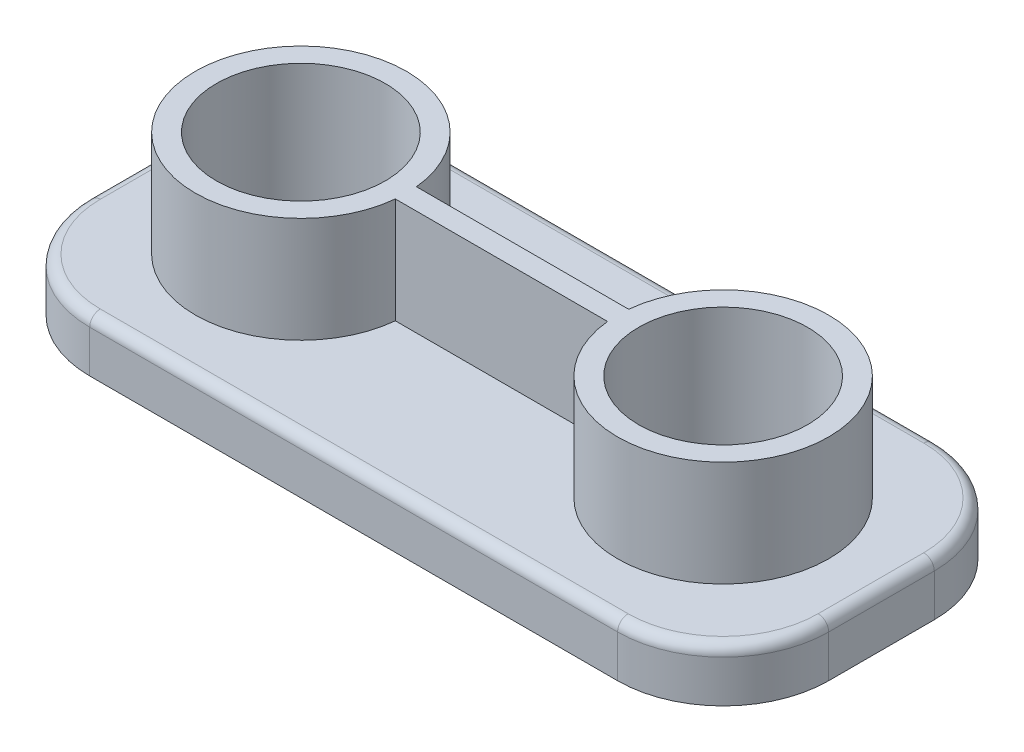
ISO-10303-21;
HEADER;
FILE_DESCRIPTION(('STEP AP214'),'2;1');
FILE_NAME('part.step','',(''),(''),'','','');
FILE_SCHEMA(('AUTOMOTIVE_DESIGN { 1 0 10303 214 1 1 1 1 }'));
ENDSEC;
DATA;
#1=APPLICATION_CONTEXT('core data for automotive mechanical design processes');
#2=APPLICATION_PROTOCOL_DEFINITION('international standard','automotive_design',2000,#1);
#3=PRODUCT_CONTEXT('',#1,'mechanical');
#4=PRODUCT('Part','Part','',(#3));
#5=PRODUCT_RELATED_PRODUCT_CATEGORY('part','',(#4));
#6=PRODUCT_DEFINITION_FORMATION('','',#4);
#7=PRODUCT_DEFINITION_CONTEXT('part definition',#1,'design');
#8=PRODUCT_DEFINITION('design','',#6,#7);
#9=PRODUCT_DEFINITION_SHAPE('','',#8);
#10=(LENGTH_UNIT() NAMED_UNIT(*) SI_UNIT(.MILLI.,.METRE.));
#11=(NAMED_UNIT(*) PLANE_ANGLE_UNIT() SI_UNIT($,.RADIAN.));
#12=(NAMED_UNIT(*) SI_UNIT($,.STERADIAN.) SOLID_ANGLE_UNIT());
#13=UNCERTAINTY_MEASURE_WITH_UNIT(LENGTH_MEASURE(1.E-05),#10,'distance_accuracy_value','');
#14=(GEOMETRIC_REPRESENTATION_CONTEXT(3) GLOBAL_UNCERTAINTY_ASSIGNED_CONTEXT((#13)) GLOBAL_UNIT_ASSIGNED_CONTEXT((#10,
#11,#12)) REPRESENTATION_CONTEXT('',''));
#15=CARTESIAN_POINT('',(0.,0.,0.));
#16=DIRECTION('',(0.,0.,1.));
#17=DIRECTION('',(1.,0.,0.));
#18=AXIS2_PLACEMENT_3D('',#15,#16,#17);
#19=CARTESIAN_POINT('',(-63.5,0.,-12.7));
#20=DIRECTION('',(0.,-1.,0.));
#21=DIRECTION('',(0.,0.,-1.));
#22=AXIS2_PLACEMENT_3D('',#19,#20,#21);
#23=PLANE('',#22);
#24=DIRECTION('',(0.,0.,-1.));
#25=VECTOR('',#24,1.);
#26=CARTESIAN_POINT('',(86.36,0.,-12.7));
#27=LINE('',#26,#25);
#28=CARTESIAN_POINT('',(86.36,0.,12.7));
#29=VERTEX_POINT('',#28);
#30=CARTESIAN_POINT('',(86.36,0.,-12.7));
#31=VERTEX_POINT('',#30);
#32=EDGE_CURVE('E220',#29,#31,#27,.T.);
#33=ORIENTED_EDGE('',*,*,#32,.T.);
#34=CARTESIAN_POINT('',(63.5,0.,-12.7));
#35=DIRECTION('',(0.,-1.,0.));
#36=DIRECTION('',(0.,0.,-1.));
#37=AXIS2_PLACEMENT_3D('',#34,#35,#36);
#38=CIRCLE('',#37,22.86);
#39=CARTESIAN_POINT('',(63.5,0.,-35.56));
#40=VERTEX_POINT('',#39);
#41=EDGE_CURVE('E222',#31,#40,#38,.F.);
#42=ORIENTED_EDGE('',*,*,#41,.T.);
#43=DIRECTION('',(-1.,0.,0.));
#44=VECTOR('',#43,1.);
#45=CARTESIAN_POINT('',(-63.5,0.,-35.56));
#46=LINE('',#45,#44);
#47=CARTESIAN_POINT('',(-63.5,0.,-35.56));
#48=VERTEX_POINT('',#47);
#49=EDGE_CURVE('E224',#40,#48,#46,.T.);
#50=ORIENTED_EDGE('',*,*,#49,.T.);
#51=CARTESIAN_POINT('',(-63.5,0.,-12.7));
#52=DIRECTION('',(0.,-1.,0.));
#53=DIRECTION('',(0.,0.,-1.));
#54=AXIS2_PLACEMENT_3D('',#51,#52,#53);
#55=CIRCLE('',#54,22.86);
#56=CARTESIAN_POINT('',(-86.36,0.,-12.7));
#57=VERTEX_POINT('',#56);
#58=EDGE_CURVE('E226',#48,#57,#55,.F.);
#59=ORIENTED_EDGE('',*,*,#58,.T.);
#60=DIRECTION('',(0.,0.,1.));
#61=VECTOR('',#60,1.);
#62=CARTESIAN_POINT('',(-86.36,0.,12.7));
#63=LINE('',#62,#61);
#64=CARTESIAN_POINT('',(-86.36,0.,12.7));
#65=VERTEX_POINT('',#64);
#66=EDGE_CURVE('E228',#57,#65,#63,.T.);
#67=ORIENTED_EDGE('',*,*,#66,.T.);
#68=CARTESIAN_POINT('',(-63.5,0.,12.7));
#69=DIRECTION('',(0.,-1.,0.));
#70=DIRECTION('',(0.,0.,-1.));
#71=AXIS2_PLACEMENT_3D('',#68,#69,#70);
#72=CIRCLE('',#71,22.86);
#73=CARTESIAN_POINT('',(-63.5,0.,35.56));
#74=VERTEX_POINT('',#73);
#75=EDGE_CURVE('E230',#65,#74,#72,.F.);
#76=ORIENTED_EDGE('',*,*,#75,.T.);
#77=DIRECTION('',(1.,0.,0.));
#78=VECTOR('',#77,1.);
#79=CARTESIAN_POINT('',(63.5,0.,35.56));
#80=LINE('',#79,#78);
#81=CARTESIAN_POINT('',(63.5,0.,35.56));
#82=VERTEX_POINT('',#81);
#83=EDGE_CURVE('E216',#74,#82,#80,.T.);
#84=ORIENTED_EDGE('',*,*,#83,.T.);
#85=CARTESIAN_POINT('',(63.5,0.,12.7));
#86=DIRECTION('',(0.,-1.,0.));
#87=DIRECTION('',(0.,0.,-1.));
#88=AXIS2_PLACEMENT_3D('',#85,#86,#87);
#89=CIRCLE('',#88,22.86);
#90=EDGE_CURVE('E218',#82,#29,#89,.F.);
#91=ORIENTED_EDGE('',*,*,#90,.T.);
#92=EDGE_LOOP('',(#33,#42,#50,#59,#67,#76,#84,#91));
#93=FACE_BOUND('',#92,.T.);
#94=DIRECTION('',(-1.,0.,0.));
#95=VECTOR('',#94,1.);
#96=CARTESIAN_POINT('',(-63.5,0.,-2.54));
#97=LINE('',#96,#95);
#98=CARTESIAN_POINT('',(25.5273190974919,0.,-2.54));
#99=VERTEX_POINT('',#98);
#100=CARTESIAN_POINT('',(-25.5273190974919,0.,-2.54));
#101=VERTEX_POINT('',#100);
#102=EDGE_CURVE('E154',#99,#101,#97,.T.);
#103=ORIENTED_EDGE('',*,*,#102,.F.);
#104=CARTESIAN_POINT('',(50.8,0.,0.));
#105=DIRECTION('',(0.,-1.,0.));
#106=DIRECTION('',(0.,0.,-1.));
#107=AXIS2_PLACEMENT_3D('',#104,#105,#106);
#108=CIRCLE('',#107,25.4);
#109=CARTESIAN_POINT('',(25.5273190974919,0.,2.54));
#110=VERTEX_POINT('',#109);
#111=EDGE_CURVE('E213',#110,#99,#108,.F.);
#112=ORIENTED_EDGE('',*,*,#111,.F.);
#113=DIRECTION('',(-1.,0.,0.));
#114=VECTOR('',#113,1.);
#115=CARTESIAN_POINT('',(-63.5,0.,2.54));
#116=LINE('',#115,#114);
#117=CARTESIAN_POINT('',(-25.5273190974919,0.,2.54));
#118=VERTEX_POINT('',#117);
#119=EDGE_CURVE('E344',#110,#118,#116,.T.);
#120=ORIENTED_EDGE('',*,*,#119,.T.);
#121=CARTESIAN_POINT('',(-50.8,0.,0.));
#122=DIRECTION('',(0.,-1.,0.));
#123=DIRECTION('',(0.,0.,-1.));
#124=AXIS2_PLACEMENT_3D('',#121,#122,#123);
#125=CIRCLE('',#124,25.4);
#126=EDGE_CURVE('E193',#101,#118,#125,.F.);
#127=ORIENTED_EDGE('',*,*,#126,.F.);
#128=EDGE_LOOP('',(#103,#112,#120,#127));
#129=FACE_BOUND('',#128,.T.);
#130=ADVANCED_FACE('F29',(#93,#129),#23,.F.);
#131=CARTESIAN_POINT('',(-63.5,-12.7,-12.7));
#132=DIRECTION('',(0.,1.,0.));
#133=DIRECTION('',(0.,0.,1.));
#134=AXIS2_PLACEMENT_3D('',#131,#132,#133);
#135=CYLINDRICAL_SURFACE('',#134,25.4);
#136=DIRECTION('',(0.,1.,0.));
#137=VECTOR('',#136,1.);
#138=CARTESIAN_POINT('',(-88.9,-12.7,-12.7));
#139=LINE('',#138,#137);
#140=CARTESIAN_POINT('',(-88.9,-12.7,-12.7));
#141=VERTEX_POINT('',#140);
#142=CARTESIAN_POINT('',(-88.9,-2.54,-12.7));
#143=VERTEX_POINT('',#142);
#144=EDGE_CURVE('E189',#141,#143,#139,.T.);
#145=ORIENTED_EDGE('',*,*,#144,.T.);
#146=CARTESIAN_POINT('',(-63.5,-2.54,-12.7));
#147=DIRECTION('',(0.,-1.,0.));
#148=DIRECTION('',(0.,0.,-1.));
#149=AXIS2_PLACEMENT_3D('',#146,#147,#148);
#150=CIRCLE('',#149,25.4);
#151=CARTESIAN_POINT('',(-63.5,-2.54,-38.1));
#152=VERTEX_POINT('',#151);
#153=EDGE_CURVE('E238',#143,#152,#150,.T.);
#154=ORIENTED_EDGE('',*,*,#153,.T.);
#155=DIRECTION('',(0.,1.,0.));
#156=VECTOR('',#155,1.);
#157=CARTESIAN_POINT('',(-63.5,-12.7,-38.1));
#158=LINE('',#157,#156);
#159=CARTESIAN_POINT('',(-63.5,-12.7,-38.1));
#160=VERTEX_POINT('',#159);
#161=EDGE_CURVE('E190',#160,#152,#158,.T.);
#162=ORIENTED_EDGE('',*,*,#161,.F.);
#163=CARTESIAN_POINT('',(-63.5,-12.7,-12.7));
#164=DIRECTION('',(0.,1.,0.));
#165=DIRECTION('',(0.,0.,-1.));
#166=AXIS2_PLACEMENT_3D('',#163,#164,#165);
#167=CIRCLE('',#166,25.4);
#168=EDGE_CURVE('E162',#160,#141,#167,.T.);
#169=ORIENTED_EDGE('',*,*,#168,.T.);
#170=EDGE_LOOP('',(#145,#154,#162,#169));
#171=FACE_BOUND('',#170,.T.);
#172=ADVANCED_FACE('F31',(#171),#135,.T.);
#173=CARTESIAN_POINT('',(-63.5,-12.7,-38.1));
#174=DIRECTION('',(0.,0.,-1.));
#175=DIRECTION('',(-1.,0.,0.));
#176=AXIS2_PLACEMENT_3D('',#173,#174,#175);
#177=PLANE('',#176);
#178=ORIENTED_EDGE('',*,*,#161,.T.);
#179=DIRECTION('',(-1.,0.,0.));
#180=VECTOR('',#179,1.);
#181=CARTESIAN_POINT('',(63.5,-2.54,-38.1));
#182=LINE('',#181,#180);
#183=CARTESIAN_POINT('',(63.5,-2.54,-38.1));
#184=VERTEX_POINT('',#183);
#185=EDGE_CURVE('E240',#152,#184,#182,.F.);
#186=ORIENTED_EDGE('',*,*,#185,.T.);
#187=DIRECTION('',(0.,1.,0.));
#188=VECTOR('',#187,1.);
#189=CARTESIAN_POINT('',(63.5,-12.7,-38.1));
#190=LINE('',#189,#188);
#191=CARTESIAN_POINT('',(63.5,-12.7,-38.1));
#192=VERTEX_POINT('',#191);
#193=EDGE_CURVE('E194',#192,#184,#190,.T.);
#194=ORIENTED_EDGE('',*,*,#193,.F.);
#195=DIRECTION('',(-1.,0.,0.));
#196=VECTOR('',#195,1.);
#197=CARTESIAN_POINT('',(-63.5,-12.7,-38.1));
#198=LINE('',#197,#196);
#199=EDGE_CURVE('E186',#192,#160,#198,.T.);
#200=ORIENTED_EDGE('',*,*,#199,.T.);
#201=EDGE_LOOP('',(#178,#186,#194,#200));
#202=FACE_BOUND('',#201,.T.);
#203=ADVANCED_FACE('F326',(#202),#177,.T.);
#204=CARTESIAN_POINT('',(63.5,-12.7,-12.7));
#205=DIRECTION('',(0.,1.,0.));
#206=DIRECTION('',(0.,0.,1.));
#207=AXIS2_PLACEMENT_3D('',#204,#205,#206);
#208=CYLINDRICAL_SURFACE('',#207,25.4);
#209=ORIENTED_EDGE('',*,*,#193,.T.);
#210=CARTESIAN_POINT('',(63.5,-2.54,-12.7));
#211=DIRECTION('',(0.,-1.,0.));
#212=DIRECTION('',(0.,0.,-1.));
#213=AXIS2_PLACEMENT_3D('',#210,#211,#212);
#214=CIRCLE('',#213,25.4);
#215=CARTESIAN_POINT('',(88.9,-2.54,-12.7));
#216=VERTEX_POINT('',#215);
#217=EDGE_CURVE('E242',#184,#216,#214,.T.);
#218=ORIENTED_EDGE('',*,*,#217,.T.);
#219=DIRECTION('',(0.,1.,0.));
#220=VECTOR('',#219,1.);
#221=CARTESIAN_POINT('',(88.9,-12.7,-12.7));
#222=LINE('',#221,#220);
#223=CARTESIAN_POINT('',(88.9,-12.7,-12.7));
#224=VERTEX_POINT('',#223);
#225=EDGE_CURVE('E197',#224,#216,#222,.T.);
#226=ORIENTED_EDGE('',*,*,#225,.F.);
#227=CARTESIAN_POINT('',(63.5,-12.7,-12.7));
#228=DIRECTION('',(0.,1.,0.));
#229=DIRECTION('',(0.,0.,-1.));
#230=AXIS2_PLACEMENT_3D('',#227,#228,#229);
#231=CIRCLE('',#230,25.4);
#232=EDGE_CURVE('E183',#224,#192,#231,.T.);
#233=ORIENTED_EDGE('',*,*,#232,.T.);
#234=EDGE_LOOP('',(#209,#218,#226,#233));
#235=FACE_BOUND('',#234,.T.);
#236=ADVANCED_FACE('F322',(#235),#208,.T.);
#237=CARTESIAN_POINT('',(88.9,-12.7,12.7));
#238=DIRECTION('',(1.,0.,0.));
#239=DIRECTION('',(0.,0.,-1.));
#240=AXIS2_PLACEMENT_3D('',#237,#238,#239);
#241=PLANE('',#240);
#242=DIRECTION('',(0.,0.,-1.));
#243=VECTOR('',#242,1.);
#244=CARTESIAN_POINT('',(88.9,-2.54,12.7));
#245=LINE('',#244,#243);
#246=CARTESIAN_POINT('',(88.9,-2.54,12.7));
#247=VERTEX_POINT('',#246);
#248=EDGE_CURVE('E244',#216,#247,#245,.F.);
#249=ORIENTED_EDGE('',*,*,#248,.T.);
#250=DIRECTION('',(0.,1.,0.));
#251=VECTOR('',#250,1.);
#252=CARTESIAN_POINT('',(88.9,-12.7,12.7));
#253=LINE('',#252,#251);
#254=CARTESIAN_POINT('',(88.9,-12.7,12.7));
#255=VERTEX_POINT('',#254);
#256=EDGE_CURVE('E200',#255,#247,#253,.T.);
#257=ORIENTED_EDGE('',*,*,#256,.F.);
#258=DIRECTION('',(0.,0.,-1.));
#259=VECTOR('',#258,1.);
#260=CARTESIAN_POINT('',(88.9,-12.7,12.7));
#261=LINE('',#260,#259);
#262=EDGE_CURVE('E181',#255,#224,#261,.T.);
#263=ORIENTED_EDGE('',*,*,#262,.T.);
#264=ORIENTED_EDGE('',*,*,#225,.T.);
#265=EDGE_LOOP('',(#249,#257,#263,#264));
#266=FACE_BOUND('',#265,.T.);
#267=ADVANCED_FACE('F247',(#266),#241,.T.);
#268=CARTESIAN_POINT('',(63.5,-12.7,12.7));
#269=DIRECTION('',(0.,1.,0.));
#270=DIRECTION('',(0.,0.,1.));
#271=AXIS2_PLACEMENT_3D('',#268,#269,#270);
#272=CYLINDRICAL_SURFACE('',#271,25.4);
#273=ORIENTED_EDGE('',*,*,#256,.T.);
#274=CARTESIAN_POINT('',(63.5,-2.54,12.7));
#275=DIRECTION('',(0.,-1.,0.));
#276=DIRECTION('',(0.,0.,-1.));
#277=AXIS2_PLACEMENT_3D('',#274,#275,#276);
#278=CIRCLE('',#277,25.4);
#279=CARTESIAN_POINT('',(63.5,-2.54,38.1));
#280=VERTEX_POINT('',#279);
#281=EDGE_CURVE('E37',#247,#280,#278,.T.);
#282=ORIENTED_EDGE('',*,*,#281,.T.);
#283=DIRECTION('',(0.,1.,0.));
#284=VECTOR('',#283,1.);
#285=CARTESIAN_POINT('',(63.5,-12.7,38.1));
#286=LINE('',#285,#284);
#287=CARTESIAN_POINT('',(63.5,-12.7,38.1));
#288=VERTEX_POINT('',#287);
#289=EDGE_CURVE('E202',#288,#280,#286,.T.);
#290=ORIENTED_EDGE('',*,*,#289,.F.);
#291=CARTESIAN_POINT('',(63.5,-12.7,12.7));
#292=DIRECTION('',(0.,1.,0.));
#293=DIRECTION('',(0.,0.,1.));
#294=AXIS2_PLACEMENT_3D('',#291,#292,#293);
#295=CIRCLE('',#294,25.4);
#296=EDGE_CURVE('E178',#288,#255,#295,.T.);
#297=ORIENTED_EDGE('',*,*,#296,.T.);
#298=EDGE_LOOP('',(#273,#282,#290,#297));
#299=FACE_BOUND('',#298,.T.);
#300=ADVANCED_FACE('F254',(#299),#272,.T.);
#301=CARTESIAN_POINT('',(-63.5,-12.7,38.1));
#302=DIRECTION('',(0.,0.,1.));
#303=DIRECTION('',(1.,0.,0.));
#304=AXIS2_PLACEMENT_3D('',#301,#302,#303);
#305=PLANE('',#304);
#306=ORIENTED_EDGE('',*,*,#289,.T.);
#307=DIRECTION('',(1.,0.,0.));
#308=VECTOR('',#307,1.);
#309=CARTESIAN_POINT('',(-63.5,-2.54,38.1));
#310=LINE('',#309,#308);
#311=CARTESIAN_POINT('',(-63.5,-2.54,38.1));
#312=VERTEX_POINT('',#311);
#313=EDGE_CURVE('E11',#280,#312,#310,.F.);
#314=ORIENTED_EDGE('',*,*,#313,.T.);
#315=DIRECTION('',(0.,1.,0.));
#316=VECTOR('',#315,1.);
#317=CARTESIAN_POINT('',(-63.5,-12.7,38.1));
#318=LINE('',#317,#316);
#319=CARTESIAN_POINT('',(-63.5,-12.7,38.1));
#320=VERTEX_POINT('',#319);
#321=EDGE_CURVE('E204',#320,#312,#318,.T.);
#322=ORIENTED_EDGE('',*,*,#321,.F.);
#323=DIRECTION('',(1.,0.,0.));
#324=VECTOR('',#323,1.);
#325=CARTESIAN_POINT('',(-63.5,-12.7,38.1));
#326=LINE('',#325,#324);
#327=EDGE_CURVE('E175',#320,#288,#326,.T.);
#328=ORIENTED_EDGE('',*,*,#327,.T.);
#329=EDGE_LOOP('',(#306,#314,#322,#328));
#330=FACE_BOUND('',#329,.T.);
#331=ADVANCED_FACE('F278',(#330),#305,.T.);
#332=CARTESIAN_POINT('',(-63.5,-12.7,12.7));
#333=DIRECTION('',(0.,1.,0.));
#334=DIRECTION('',(0.,0.,1.));
#335=AXIS2_PLACEMENT_3D('',#332,#333,#334);
#336=CYLINDRICAL_SURFACE('',#335,25.4);
#337=ORIENTED_EDGE('',*,*,#321,.T.);
#338=CARTESIAN_POINT('',(-63.5,-2.54,12.7));
#339=DIRECTION('',(0.,-1.,0.));
#340=DIRECTION('',(0.,0.,-1.));
#341=AXIS2_PLACEMENT_3D('',#338,#339,#340);
#342=CIRCLE('',#341,25.4);
#343=CARTESIAN_POINT('',(-88.9,-2.54,12.7));
#344=VERTEX_POINT('',#343);
#345=EDGE_CURVE('E233',#312,#344,#342,.T.);
#346=ORIENTED_EDGE('',*,*,#345,.T.);
#347=DIRECTION('',(0.,1.,0.));
#348=VECTOR('',#347,1.);
#349=CARTESIAN_POINT('',(-88.9,-12.7,12.7));
#350=LINE('',#349,#348);
#351=CARTESIAN_POINT('',(-88.9,-12.7,12.7));
#352=VERTEX_POINT('',#351);
#353=EDGE_CURVE('E207',#352,#344,#350,.T.);
#354=ORIENTED_EDGE('',*,*,#353,.F.);
#355=CARTESIAN_POINT('',(-63.5,-12.7,12.7));
#356=DIRECTION('',(0.,1.,0.));
#357=DIRECTION('',(0.,0.,-1.));
#358=AXIS2_PLACEMENT_3D('',#355,#356,#357);
#359=CIRCLE('',#358,25.4);
#360=EDGE_CURVE('E172',#352,#320,#359,.T.);
#361=ORIENTED_EDGE('',*,*,#360,.T.);
#362=EDGE_LOOP('',(#337,#346,#354,#361));
#363=FACE_BOUND('',#362,.T.);
#364=ADVANCED_FACE('F282',(#363),#336,.T.);
#365=CARTESIAN_POINT('',(-88.9,-12.7,12.7));
#366=DIRECTION('',(-1.,0.,0.));
#367=DIRECTION('',(0.,0.,1.));
#368=AXIS2_PLACEMENT_3D('',#365,#366,#367);
#369=PLANE('',#368);
#370=DIRECTION('',(0.,0.,1.));
#371=VECTOR('',#370,1.);
#372=CARTESIAN_POINT('',(-88.9,-2.54,-12.7));
#373=LINE('',#372,#371);
#374=EDGE_CURVE('E236',#344,#143,#373,.F.);
#375=ORIENTED_EDGE('',*,*,#374,.T.);
#376=ORIENTED_EDGE('',*,*,#144,.F.);
#377=DIRECTION('',(0.,0.,1.));
#378=VECTOR('',#377,1.);
#379=CARTESIAN_POINT('',(-88.9,-12.7,12.7));
#380=LINE('',#379,#378);
#381=EDGE_CURVE('E165',#141,#352,#380,.T.);
#382=ORIENTED_EDGE('',*,*,#381,.T.);
#383=ORIENTED_EDGE('',*,*,#353,.T.);
#384=EDGE_LOOP('',(#375,#376,#382,#383));
#385=FACE_BOUND('',#384,.T.);
#386=ADVANCED_FACE('F297',(#385),#369,.T.);
#387=CARTESIAN_POINT('',(-63.5,-12.7,-12.7));
#388=DIRECTION('',(0.,-1.,0.));
#389=DIRECTION('',(0.,0.,-1.));
#390=AXIS2_PLACEMENT_3D('',#387,#388,#389);
#391=PLANE('',#390);
#392=CARTESIAN_POINT('',(50.8,-12.7,0.));
#393=DIRECTION('',(0.,1.,0.));
#394=DIRECTION('',(0.,0.,1.));
#395=AXIS2_PLACEMENT_3D('',#392,#393,#394);
#396=CIRCLE('',#395,20.32);
#397=CARTESIAN_POINT('',(50.8,-12.7,20.32));
#398=VERTEX_POINT('',#397);
#399=EDGE_CURVE('E341',#398,#398,#396,.T.);
#400=ORIENTED_EDGE('',*,*,#399,.T.);
#401=EDGE_LOOP('',(#400));
#402=FACE_BOUND('',#401,.T.);
#403=ORIENTED_EDGE('',*,*,#232,.F.);
#404=ORIENTED_EDGE('',*,*,#262,.F.);
#405=ORIENTED_EDGE('',*,*,#296,.F.);
#406=ORIENTED_EDGE('',*,*,#327,.F.);
#407=ORIENTED_EDGE('',*,*,#360,.F.);
#408=ORIENTED_EDGE('',*,*,#381,.F.);
#409=ORIENTED_EDGE('',*,*,#168,.F.);
#410=ORIENTED_EDGE('',*,*,#199,.F.);
#411=EDGE_LOOP('',(#403,#404,#405,#406,#407,#408,#409,#410));
#412=FACE_BOUND('',#411,.T.);
#413=CARTESIAN_POINT('',(-50.8,-12.7,0.));
#414=DIRECTION('',(0.,1.,0.));
#415=DIRECTION('',(0.,0.,1.));
#416=AXIS2_PLACEMENT_3D('',#413,#414,#415);
#417=CIRCLE('',#416,20.32);
#418=CARTESIAN_POINT('',(-50.8,-12.7,20.32));
#419=VERTEX_POINT('',#418);
#420=EDGE_CURVE('E335',#419,#419,#417,.T.);
#421=ORIENTED_EDGE('',*,*,#420,.T.);
#422=EDGE_LOOP('',(#421));
#423=FACE_BOUND('',#422,.T.);
#424=ADVANCED_FACE('F328',(#402,#412,#423),#391,.T.);
#425=CARTESIAN_POINT('',(-50.8,25.4,0.));
#426=DIRECTION('',(0.,-1.,0.));
#427=DIRECTION('',(0.,0.,-1.));
#428=AXIS2_PLACEMENT_3D('',#425,#426,#427);
#429=CYLINDRICAL_SURFACE('',#428,25.4);
#430=DIRECTION('',(0.,-1.,0.));
#431=VECTOR('',#430,1.);
#432=CARTESIAN_POINT('',(-25.5273190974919,25.4,2.54));
#433=LINE('',#432,#431);
#434=CARTESIAN_POINT('',(-25.5273190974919,25.4,2.54));
#435=VERTEX_POINT('',#434);
#436=EDGE_CURVE('E158',#118,#435,#433,.F.);
#437=ORIENTED_EDGE('',*,*,#436,.T.);
#438=CARTESIAN_POINT('',(-50.8,25.4,0.));
#439=DIRECTION('',(0.,1.,0.));
#440=DIRECTION('',(0.,0.,1.));
#441=AXIS2_PLACEMENT_3D('',#438,#439,#440);
#442=CIRCLE('',#441,25.4);
#443=CARTESIAN_POINT('',(-25.5273190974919,25.4,-2.54));
#444=VERTEX_POINT('',#443);
#445=EDGE_CURVE('E144',#444,#435,#442,.T.);
#446=ORIENTED_EDGE('',*,*,#445,.F.);
#447=DIRECTION('',(0.,-1.,0.));
#448=VECTOR('',#447,1.);
#449=CARTESIAN_POINT('',(-25.5273190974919,25.4,-2.54));
#450=LINE('',#449,#448);
#451=EDGE_CURVE('E152',#101,#444,#450,.F.);
#452=ORIENTED_EDGE('',*,*,#451,.F.);
#453=ORIENTED_EDGE('',*,*,#126,.T.);
#454=EDGE_LOOP('',(#437,#446,#452,#453));
#455=FACE_BOUND('',#454,.T.);
#456=ADVANCED_FACE('F160',(#455),#429,.T.);
#457=CARTESIAN_POINT('',(-50.8,25.4,0.));
#458=DIRECTION('',(0.,1.,0.));
#459=DIRECTION('',(0.,0.,1.));
#460=AXIS2_PLACEMENT_3D('',#457,#458,#459);
#461=PLANE('',#460);
#462=CARTESIAN_POINT('',(-50.8,25.4,0.));
#463=DIRECTION('',(0.,1.,0.));
#464=DIRECTION('',(0.,0.,1.));
#465=AXIS2_PLACEMENT_3D('',#462,#463,#464);
#466=CIRCLE('',#465,20.32);
#467=CARTESIAN_POINT('',(-50.8,25.4,20.32));
#468=VERTEX_POINT('',#467);
#469=EDGE_CURVE('E338',#468,#468,#466,.T.);
#470=ORIENTED_EDGE('',*,*,#469,.F.);
#471=EDGE_LOOP('',(#470));
#472=FACE_BOUND('',#471,.T.);
#473=ORIENTED_EDGE('',*,*,#445,.T.);
#474=DIRECTION('',(1.,0.,0.));
#475=VECTOR('',#474,1.);
#476=CARTESIAN_POINT('',(25.4,25.4,2.54));
#477=LINE('',#476,#475);
#478=CARTESIAN_POINT('',(25.5273190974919,25.4,2.54));
#479=VERTEX_POINT('',#478);
#480=EDGE_CURVE('E149',#479,#435,#477,.F.);
#481=ORIENTED_EDGE('',*,*,#480,.F.);
#482=CARTESIAN_POINT('',(50.8,25.4,0.));
#483=DIRECTION('',(0.,1.,0.));
#484=DIRECTION('',(0.,0.,1.));
#485=AXIS2_PLACEMENT_3D('',#482,#483,#484);
#486=CIRCLE('',#485,25.4);
#487=CARTESIAN_POINT('',(25.5273190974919,25.4,-2.54));
#488=VERTEX_POINT('',#487);
#489=EDGE_CURVE('E44',#479,#488,#486,.T.);
#490=ORIENTED_EDGE('',*,*,#489,.T.);
#491=DIRECTION('',(-1.,0.,0.));
#492=VECTOR('',#491,1.);
#493=CARTESIAN_POINT('',(25.4,25.4,-2.54));
#494=LINE('',#493,#492);
#495=EDGE_CURVE('E139',#444,#488,#494,.F.);
#496=ORIENTED_EDGE('',*,*,#495,.F.);
#497=EDGE_LOOP('',(#473,#481,#490,#496));
#498=FACE_BOUND('',#497,.T.);
#499=CARTESIAN_POINT('',(50.8,25.4,0.));
#500=DIRECTION('',(0.,1.,0.));
#501=DIRECTION('',(0.,0.,1.));
#502=AXIS2_PLACEMENT_3D('',#499,#500,#501);
#503=CIRCLE('',#502,20.32);
#504=CARTESIAN_POINT('',(50.8,25.4,20.32));
#505=VERTEX_POINT('',#504);
#506=EDGE_CURVE('E337',#505,#505,#503,.T.);
#507=ORIENTED_EDGE('',*,*,#506,.F.);
#508=EDGE_LOOP('',(#507));
#509=FACE_BOUND('',#508,.T.);
#510=ADVANCED_FACE('F141',(#472,#498,#509),#461,.T.);
#511=CARTESIAN_POINT('',(50.8,25.4,0.));
#512=DIRECTION('',(0.,-1.,0.));
#513=DIRECTION('',(0.,0.,-1.));
#514=AXIS2_PLACEMENT_3D('',#511,#512,#513);
#515=CYLINDRICAL_SURFACE('',#514,25.4);
#516=DIRECTION('',(0.,-1.,0.));
#517=VECTOR('',#516,1.);
#518=CARTESIAN_POINT('',(25.5273190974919,25.4,-2.54));
#519=LINE('',#518,#517);
#520=EDGE_CURVE('E507',#99,#488,#519,.F.);
#521=ORIENTED_EDGE('',*,*,#520,.T.);
#522=ORIENTED_EDGE('',*,*,#489,.F.);
#523=DIRECTION('',(0.,-1.,0.));
#524=VECTOR('',#523,1.);
#525=CARTESIAN_POINT('',(25.5273190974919,25.4,2.54));
#526=LINE('',#525,#524);
#527=EDGE_CURVE('E505',#110,#479,#526,.F.);
#528=ORIENTED_EDGE('',*,*,#527,.F.);
#529=ORIENTED_EDGE('',*,*,#111,.T.);
#530=EDGE_LOOP('',(#521,#522,#528,#529));
#531=FACE_BOUND('',#530,.T.);
#532=ADVANCED_FACE('F359',(#531),#515,.T.);
#533=CARTESIAN_POINT('',(63.5,-2.54,-12.7));
#534=DIRECTION('',(0.,-1.,0.));
#535=DIRECTION('',(0.,0.,-1.));
#536=AXIS2_PLACEMENT_3D('',#533,#534,#535);
#537=TOROIDAL_SURFACE('',#536,22.86,2.54);
#538=CARTESIAN_POINT('',(86.36,-2.54,-12.7));
#539=DIRECTION('',(0.,0.,1.));
#540=DIRECTION('',(1.,0.,0.));
#541=AXIS2_PLACEMENT_3D('',#538,#539,#540);
#542=CIRCLE('',#541,2.54);
#543=EDGE_CURVE('E310',#216,#31,#542,.T.);
#544=ORIENTED_EDGE('',*,*,#543,.F.);
#545=ORIENTED_EDGE('',*,*,#217,.F.);
#546=CARTESIAN_POINT('',(63.5,-2.54,-35.56));
#547=DIRECTION('',(-1.,0.,0.));
#548=DIRECTION('',(0.,0.,1.));
#549=AXIS2_PLACEMENT_3D('',#546,#547,#548);
#550=CIRCLE('',#549,2.54);
#551=EDGE_CURVE('E167',#40,#184,#550,.T.);
#552=ORIENTED_EDGE('',*,*,#551,.F.);
#553=ORIENTED_EDGE('',*,*,#41,.F.);
#554=EDGE_LOOP('',(#544,#545,#552,#553));
#555=FACE_BOUND('',#554,.T.);
#556=ADVANCED_FACE('F320',(#555),#537,.T.);
#557=CARTESIAN_POINT('',(-63.5,-2.54,-35.56));
#558=DIRECTION('',(1.,0.,0.));
#559=DIRECTION('',(0.,0.,-1.));
#560=AXIS2_PLACEMENT_3D('',#557,#558,#559);
#561=CYLINDRICAL_SURFACE('',#560,2.54);
#562=ORIENTED_EDGE('',*,*,#551,.T.);
#563=ORIENTED_EDGE('',*,*,#185,.F.);
#564=CARTESIAN_POINT('',(-63.5,-2.54,-35.56));
#565=DIRECTION('',(-1.,0.,0.));
#566=DIRECTION('',(0.,0.,1.));
#567=AXIS2_PLACEMENT_3D('',#564,#565,#566);
#568=CIRCLE('',#567,2.54);
#569=EDGE_CURVE('E262',#48,#152,#568,.T.);
#570=ORIENTED_EDGE('',*,*,#569,.F.);
#571=ORIENTED_EDGE('',*,*,#49,.F.);
#572=EDGE_LOOP('',(#562,#563,#570,#571));
#573=FACE_BOUND('',#572,.T.);
#574=ADVANCED_FACE('F316',(#573),#561,.T.);
#575=CARTESIAN_POINT('',(86.36,-2.54,-12.7));
#576=DIRECTION('',(0.,0.,1.));
#577=DIRECTION('',(1.,0.,0.));
#578=AXIS2_PLACEMENT_3D('',#575,#576,#577);
#579=CYLINDRICAL_SURFACE('',#578,2.54);
#580=ORIENTED_EDGE('',*,*,#543,.T.);
#581=ORIENTED_EDGE('',*,*,#32,.F.);
#582=CARTESIAN_POINT('',(86.36,-2.54,12.7));
#583=DIRECTION('',(0.,0.,1.));
#584=DIRECTION('',(1.,0.,0.));
#585=AXIS2_PLACEMENT_3D('',#582,#583,#584);
#586=CIRCLE('',#585,2.54);
#587=EDGE_CURVE('E258',#247,#29,#586,.T.);
#588=ORIENTED_EDGE('',*,*,#587,.F.);
#589=ORIENTED_EDGE('',*,*,#248,.F.);
#590=EDGE_LOOP('',(#580,#581,#588,#589));
#591=FACE_BOUND('',#590,.T.);
#592=ADVANCED_FACE('F259',(#591),#579,.T.);
#593=CARTESIAN_POINT('',(-63.5,-2.54,-12.7));
#594=DIRECTION('',(0.,-1.,0.));
#595=DIRECTION('',(0.,0.,-1.));
#596=AXIS2_PLACEMENT_3D('',#593,#594,#595);
#597=TOROIDAL_SURFACE('',#596,22.86,2.54);
#598=ORIENTED_EDGE('',*,*,#569,.T.);
#599=ORIENTED_EDGE('',*,*,#153,.F.);
#600=CARTESIAN_POINT('',(-86.36,-2.54,-12.7));
#601=DIRECTION('',(0.,0.,1.));
#602=DIRECTION('',(1.,0.,0.));
#603=AXIS2_PLACEMENT_3D('',#600,#601,#602);
#604=CIRCLE('',#603,2.54);
#605=EDGE_CURVE('E263',#57,#143,#604,.T.);
#606=ORIENTED_EDGE('',*,*,#605,.F.);
#607=ORIENTED_EDGE('',*,*,#58,.F.);
#608=EDGE_LOOP('',(#598,#599,#606,#607));
#609=FACE_BOUND('',#608,.T.);
#610=ADVANCED_FACE('F304',(#609),#597,.T.);
#611=CARTESIAN_POINT('',(63.5,-2.54,12.7));
#612=DIRECTION('',(0.,-1.,0.));
#613=DIRECTION('',(0.,0.,-1.));
#614=AXIS2_PLACEMENT_3D('',#611,#612,#613);
#615=TOROIDAL_SURFACE('',#614,22.86,2.54);
#616=ORIENTED_EDGE('',*,*,#587,.T.);
#617=ORIENTED_EDGE('',*,*,#90,.F.);
#618=CARTESIAN_POINT('',(63.5,-2.54,35.56));
#619=DIRECTION('',(-1.,0.,0.));
#620=DIRECTION('',(0.,0.,1.));
#621=AXIS2_PLACEMENT_3D('',#618,#619,#620);
#622=CIRCLE('',#621,2.54);
#623=EDGE_CURVE('E268',#280,#82,#622,.T.);
#624=ORIENTED_EDGE('',*,*,#623,.F.);
#625=ORIENTED_EDGE('',*,*,#281,.F.);
#626=EDGE_LOOP('',(#616,#617,#624,#625));
#627=FACE_BOUND('',#626,.T.);
#628=ADVANCED_FACE('F266',(#627),#615,.T.);
#629=CARTESIAN_POINT('',(-86.36,-2.54,-12.7));
#630=DIRECTION('',(0.,0.,-1.));
#631=DIRECTION('',(-1.,0.,0.));
#632=AXIS2_PLACEMENT_3D('',#629,#630,#631);
#633=CYLINDRICAL_SURFACE('',#632,2.54);
#634=CARTESIAN_POINT('',(-86.36,-2.54,12.7));
#635=DIRECTION('',(0.,0.,1.));
#636=DIRECTION('',(1.,0.,0.));
#637=AXIS2_PLACEMENT_3D('',#634,#635,#636);
#638=CIRCLE('',#637,2.54);
#639=EDGE_CURVE('E272',#65,#344,#638,.T.);
#640=ORIENTED_EDGE('',*,*,#639,.F.);
#641=ORIENTED_EDGE('',*,*,#66,.F.);
#642=ORIENTED_EDGE('',*,*,#605,.T.);
#643=ORIENTED_EDGE('',*,*,#374,.F.);
#644=EDGE_LOOP('',(#640,#641,#642,#643));
#645=FACE_BOUND('',#644,.T.);
#646=ADVANCED_FACE('F294',(#645),#633,.T.);
#647=CARTESIAN_POINT('',(-63.5,-2.54,35.56));
#648=DIRECTION('',(-1.,0.,0.));
#649=DIRECTION('',(0.,0.,1.));
#650=AXIS2_PLACEMENT_3D('',#647,#648,#649);
#651=CYLINDRICAL_SURFACE('',#650,2.54);
#652=ORIENTED_EDGE('',*,*,#623,.T.);
#653=ORIENTED_EDGE('',*,*,#83,.F.);
#654=CARTESIAN_POINT('',(-63.5,-2.54,35.56));
#655=DIRECTION('',(-1.,0.,0.));
#656=DIRECTION('',(0.,0.,1.));
#657=AXIS2_PLACEMENT_3D('',#654,#655,#656);
#658=CIRCLE('',#657,2.54);
#659=EDGE_CURVE('E276',#312,#74,#658,.T.);
#660=ORIENTED_EDGE('',*,*,#659,.F.);
#661=ORIENTED_EDGE('',*,*,#313,.F.);
#662=EDGE_LOOP('',(#652,#653,#660,#661));
#663=FACE_BOUND('',#662,.T.);
#664=ADVANCED_FACE('F275',(#663),#651,.T.);
#665=CARTESIAN_POINT('',(-63.5,-2.54,12.7));
#666=DIRECTION('',(0.,-1.,0.));
#667=DIRECTION('',(0.,0.,-1.));
#668=AXIS2_PLACEMENT_3D('',#665,#666,#667);
#669=TOROIDAL_SURFACE('',#668,22.86,2.54);
#670=ORIENTED_EDGE('',*,*,#639,.T.);
#671=ORIENTED_EDGE('',*,*,#345,.F.);
#672=ORIENTED_EDGE('',*,*,#659,.T.);
#673=ORIENTED_EDGE('',*,*,#75,.F.);
#674=EDGE_LOOP('',(#670,#671,#672,#673));
#675=FACE_BOUND('',#674,.T.);
#676=ADVANCED_FACE('F286',(#675),#669,.T.);
#677=CARTESIAN_POINT('',(50.8,-12.7,0.));
#678=DIRECTION('',(0.,1.,0.));
#679=DIRECTION('',(0.,0.,1.));
#680=AXIS2_PLACEMENT_3D('',#677,#678,#679);
#681=CYLINDRICAL_SURFACE('',#680,20.32);
#682=ORIENTED_EDGE('',*,*,#399,.F.);
#683=EDGE_LOOP('',(#682));
#684=FACE_BOUND('',#683,.T.);
#685=ORIENTED_EDGE('',*,*,#506,.T.);
#686=EDGE_LOOP('',(#685));
#687=FACE_BOUND('',#686,.T.);
#688=ADVANCED_FACE('F352',(#684,#687),#681,.F.);
#689=CARTESIAN_POINT('',(-50.8,-12.7,0.));
#690=DIRECTION('',(0.,1.,0.));
#691=DIRECTION('',(0.,0.,1.));
#692=AXIS2_PLACEMENT_3D('',#689,#690,#691);
#693=CYLINDRICAL_SURFACE('',#692,20.32);
#694=ORIENTED_EDGE('',*,*,#420,.F.);
#695=EDGE_LOOP('',(#694));
#696=FACE_BOUND('',#695,.T.);
#697=ORIENTED_EDGE('',*,*,#469,.T.);
#698=EDGE_LOOP('',(#697));
#699=FACE_BOUND('',#698,.T.);
#700=ADVANCED_FACE('F355',(#696,#699),#693,.F.);
#701=CARTESIAN_POINT('',(25.4,25.4,2.54));
#702=DIRECTION('',(0.,0.,1.));
#703=DIRECTION('',(1.,0.,0.));
#704=AXIS2_PLACEMENT_3D('',#701,#702,#703);
#705=PLANE('',#704);
#706=ORIENTED_EDGE('',*,*,#119,.F.);
#707=ORIENTED_EDGE('',*,*,#527,.T.);
#708=ORIENTED_EDGE('',*,*,#480,.T.);
#709=ORIENTED_EDGE('',*,*,#436,.F.);
#710=EDGE_LOOP('',(#706,#707,#708,#709));
#711=FACE_BOUND('',#710,.T.);
#712=ADVANCED_FACE('F473',(#711),#705,.T.);
#713=CARTESIAN_POINT('',(25.4,25.4,-2.54));
#714=DIRECTION('',(0.,0.,1.));
#715=DIRECTION('',(1.,0.,0.));
#716=AXIS2_PLACEMENT_3D('',#713,#714,#715);
#717=PLANE('',#716);
#718=ORIENTED_EDGE('',*,*,#102,.T.);
#719=ORIENTED_EDGE('',*,*,#451,.T.);
#720=ORIENTED_EDGE('',*,*,#495,.T.);
#721=ORIENTED_EDGE('',*,*,#520,.F.);
#722=EDGE_LOOP('',(#718,#719,#720,#721));
#723=FACE_BOUND('',#722,.T.);
#724=ADVANCED_FACE('F153',(#723),#717,.F.);
#725=CLOSED_SHELL('',(#130,#172,#203,#236,#267,#300,#331,#364,#386,#424,#456,#510,#532,#556,
#574,#592,#610,#628,#646,#664,#676,#688,#700,#712,#724));
#726=MANIFOLD_SOLID_BREP('B2',#725);
#727=ADVANCED_BREP_SHAPE_REPRESENTATION('',(#18,#726),#14);
#728=SHAPE_DEFINITION_REPRESENTATION(#9,#727);
ENDSEC;
END-ISO-10303-21;
